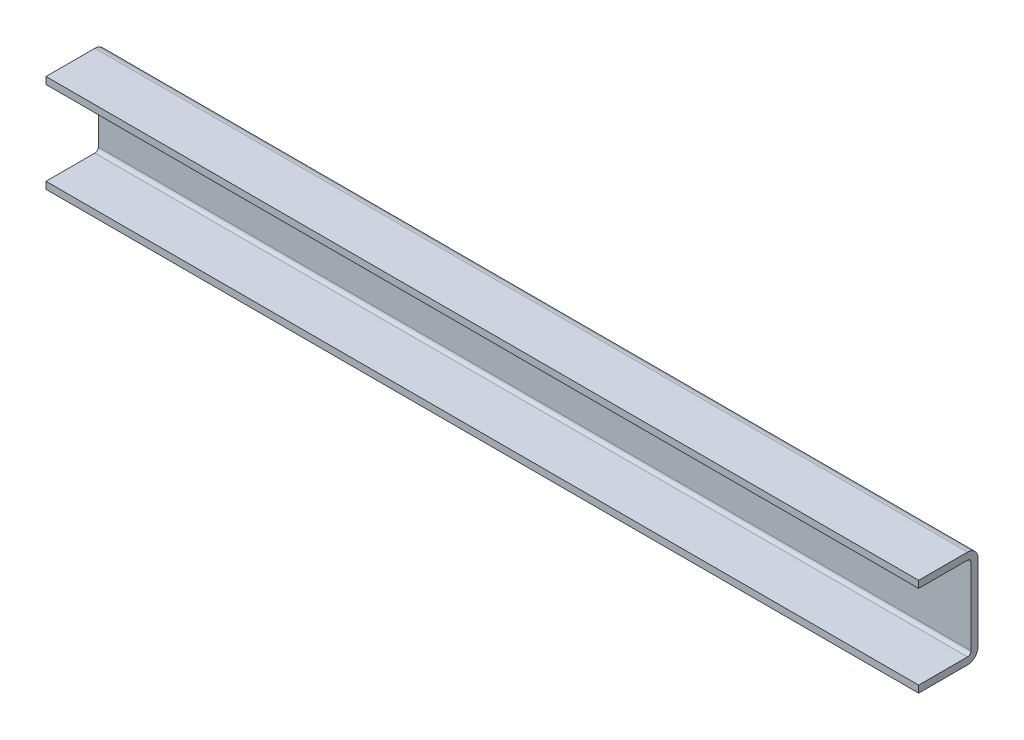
from build123d import *

# Parameters (mm, degrees)
BOSS_EXTRU_1_DEPTH = 625


with BuildPart() as part:
    # Esquisse1 → Boss.-Extru.1 (new body)
    with BuildSketch(Plane(origin=(312.5, 0, 0), x_dir=(0, 0, -1), z_dir=(1, 0, 0))):
        with BuildLine():
            Line((0, 35), (0, 30))
            Line((0, 30), (35, 30))
            ThreePointArc((35, 30), (36.767766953, 29.267766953), (37.5, 27.5))
            Line((37.5, 27.5), (37.5, -27.5))
            ThreePointArc((37.5, -27.5), (36.767766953, -29.267766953), (35, -30))
            Line((35, -30), (0, -30))
            Line((0, -30), (0, -35))
            Line((0, -35), (35, -35))
            ThreePointArc((35, -35), (40.303300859, -32.803300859), (42.5, -27.5))
            Line((42.5, -27.5), (42.5, 27.5))
            ThreePointArc((42.5, 27.5), (40.303300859, 32.803300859), (35, 35))
            Line((35, 35), (0, 35))
        make_face()
    extrude(amount=-BOSS_EXTRU_1_DEPTH)


solid = part.part
